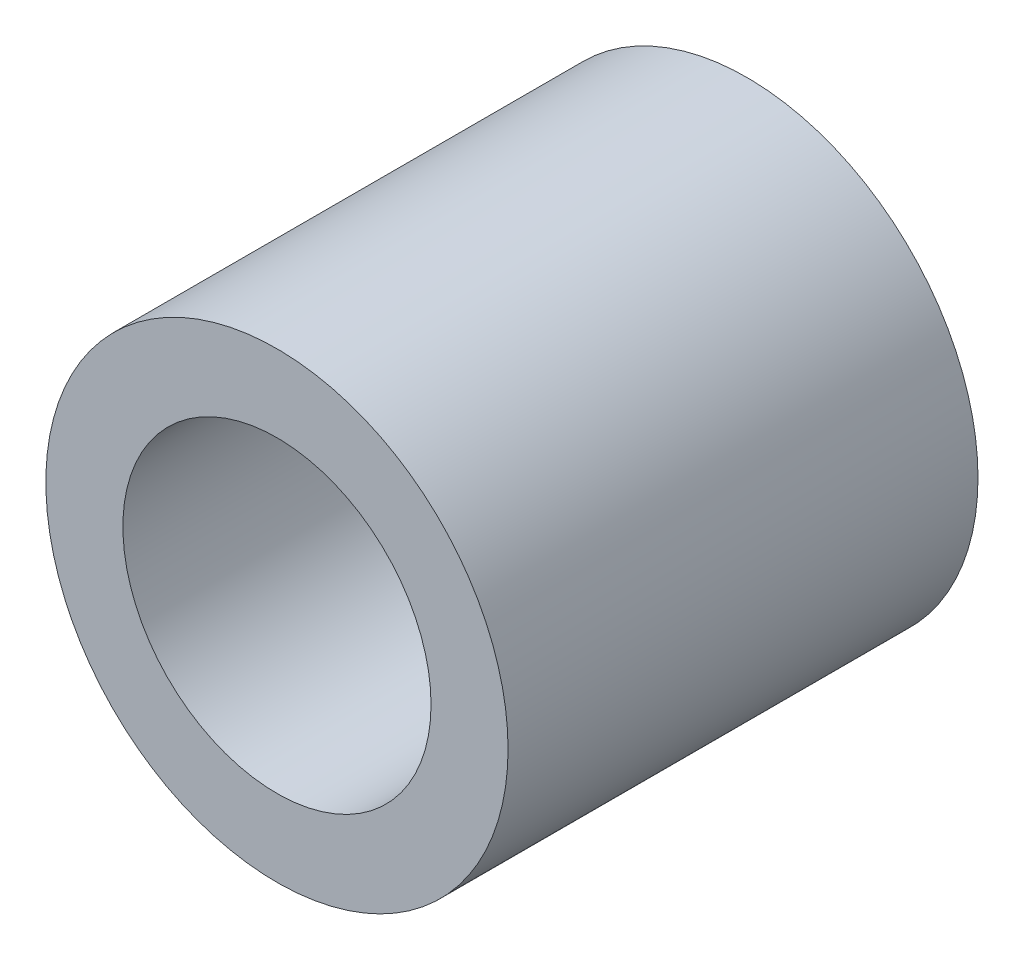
ISO-10303-21;
HEADER;
FILE_DESCRIPTION(('STEP AP214'),'2;1');
FILE_NAME('part.step','',(''),(''),'','','');
FILE_SCHEMA(('AUTOMOTIVE_DESIGN { 1 0 10303 214 1 1 1 1 }'));
ENDSEC;
DATA;
#1=APPLICATION_CONTEXT('core data for automotive mechanical design processes');
#2=APPLICATION_PROTOCOL_DEFINITION('international standard','automotive_design',2000,#1);
#3=PRODUCT_CONTEXT('',#1,'mechanical');
#4=PRODUCT('Part','Part','',(#3));
#5=PRODUCT_RELATED_PRODUCT_CATEGORY('part','',(#4));
#6=PRODUCT_DEFINITION_FORMATION('','',#4);
#7=PRODUCT_DEFINITION_CONTEXT('part definition',#1,'design');
#8=PRODUCT_DEFINITION('design','',#6,#7);
#9=PRODUCT_DEFINITION_SHAPE('','',#8);
#10=(LENGTH_UNIT() NAMED_UNIT(*) SI_UNIT(.MILLI.,.METRE.));
#11=(NAMED_UNIT(*) PLANE_ANGLE_UNIT() SI_UNIT($,.RADIAN.));
#12=(NAMED_UNIT(*) SI_UNIT($,.STERADIAN.) SOLID_ANGLE_UNIT());
#13=UNCERTAINTY_MEASURE_WITH_UNIT(LENGTH_MEASURE(1.E-05),#10,'distance_accuracy_value','');
#14=(GEOMETRIC_REPRESENTATION_CONTEXT(3) GLOBAL_UNCERTAINTY_ASSIGNED_CONTEXT((#13)) GLOBAL_UNIT_ASSIGNED_CONTEXT((#10,
#11,#12)) REPRESENTATION_CONTEXT('',''));
#15=CARTESIAN_POINT('',(0.,0.,0.));
#16=DIRECTION('',(0.,0.,1.));
#17=DIRECTION('',(1.,0.,0.));
#18=AXIS2_PLACEMENT_3D('',#15,#16,#17);
#19=CARTESIAN_POINT('',(0.,0.,6.1));
#20=DIRECTION('',(0.,0.,1.));
#21=DIRECTION('',(1.,0.,0.));
#22=AXIS2_PLACEMENT_3D('',#19,#20,#21);
#23=PLANE('',#22);
#24=CARTESIAN_POINT('',(0.,0.,6.1));
#25=DIRECTION('',(0.,0.,1.));
#26=DIRECTION('',(1.,0.,0.));
#27=AXIS2_PLACEMENT_3D('',#24,#25,#26);
#28=CIRCLE('',#27,3.);
#29=CARTESIAN_POINT('',(3.,0.,6.1));
#30=VERTEX_POINT('',#29);
#31=EDGE_CURVE('E10',#30,#30,#28,.T.);
#32=ORIENTED_EDGE('',*,*,#31,.T.);
#33=EDGE_LOOP('',(#32));
#34=FACE_BOUND('',#33,.T.);
#35=CARTESIAN_POINT('',(0.,0.,6.1));
#36=DIRECTION('',(0.,0.,1.));
#37=DIRECTION('',(1.,0.,0.));
#38=AXIS2_PLACEMENT_3D('',#35,#36,#37);
#39=CIRCLE('',#38,2.);
#40=CARTESIAN_POINT('',(2.,0.,6.1));
#41=VERTEX_POINT('',#40);
#42=EDGE_CURVE('E41',#41,#41,#39,.T.);
#43=ORIENTED_EDGE('',*,*,#42,.F.);
#44=EDGE_LOOP('',(#43));
#45=FACE_BOUND('',#44,.T.);
#46=ADVANCED_FACE('F30',(#34,#45),#23,.T.);
#47=CARTESIAN_POINT('',(0.,0.,0.));
#48=DIRECTION('',(0.,0.,1.));
#49=DIRECTION('',(1.,0.,0.));
#50=AXIS2_PLACEMENT_3D('',#47,#48,#49);
#51=PLANE('',#50);
#52=CARTESIAN_POINT('',(0.,0.,0.));
#53=DIRECTION('',(0.,0.,1.));
#54=DIRECTION('',(1.,0.,0.));
#55=AXIS2_PLACEMENT_3D('',#52,#53,#54);
#56=CIRCLE('',#55,3.);
#57=CARTESIAN_POINT('',(3.,0.,0.));
#58=VERTEX_POINT('',#57);
#59=EDGE_CURVE('E37',#58,#58,#56,.T.);
#60=ORIENTED_EDGE('',*,*,#59,.F.);
#61=EDGE_LOOP('',(#60));
#62=FACE_BOUND('',#61,.T.);
#63=CARTESIAN_POINT('',(0.,0.,0.));
#64=DIRECTION('',(0.,0.,1.));
#65=DIRECTION('',(1.,0.,0.));
#66=AXIS2_PLACEMENT_3D('',#63,#64,#65);
#67=CIRCLE('',#66,2.);
#68=CARTESIAN_POINT('',(2.,0.,0.));
#69=VERTEX_POINT('',#68);
#70=EDGE_CURVE('E45',#69,#69,#67,.T.);
#71=ORIENTED_EDGE('',*,*,#70,.T.);
#72=EDGE_LOOP('',(#71));
#73=FACE_BOUND('',#72,.T.);
#74=ADVANCED_FACE('F51',(#62,#73),#51,.F.);
#75=CARTESIAN_POINT('',(0.,0.,6.1));
#76=DIRECTION('',(0.,0.,-1.));
#77=DIRECTION('',(-1.,0.,0.));
#78=AXIS2_PLACEMENT_3D('',#75,#76,#77);
#79=CYLINDRICAL_SURFACE('',#78,3.);
#80=ORIENTED_EDGE('',*,*,#31,.F.);
#81=EDGE_LOOP('',(#80));
#82=FACE_BOUND('',#81,.T.);
#83=ORIENTED_EDGE('',*,*,#59,.T.);
#84=EDGE_LOOP('',(#83));
#85=FACE_BOUND('',#84,.T.);
#86=ADVANCED_FACE('F32',(#82,#85),#79,.T.);
#87=CARTESIAN_POINT('',(0.,0.,6.1));
#88=DIRECTION('',(0.,0.,-1.));
#89=DIRECTION('',(-1.,0.,0.));
#90=AXIS2_PLACEMENT_3D('',#87,#88,#89);
#91=CYLINDRICAL_SURFACE('',#90,2.);
#92=ORIENTED_EDGE('',*,*,#42,.T.);
#93=EDGE_LOOP('',(#92));
#94=FACE_BOUND('',#93,.T.);
#95=ORIENTED_EDGE('',*,*,#70,.F.);
#96=EDGE_LOOP('',(#95));
#97=FACE_BOUND('',#96,.T.);
#98=ADVANCED_FACE('F53',(#94,#97),#91,.F.);
#99=CLOSED_SHELL('',(#46,#74,#86,#98));
#100=MANIFOLD_SOLID_BREP('B2',#99);
#101=ADVANCED_BREP_SHAPE_REPRESENTATION('',(#18,#100),#14);
#102=SHAPE_DEFINITION_REPRESENTATION(#9,#101);
ENDSEC;
END-ISO-10303-21;
